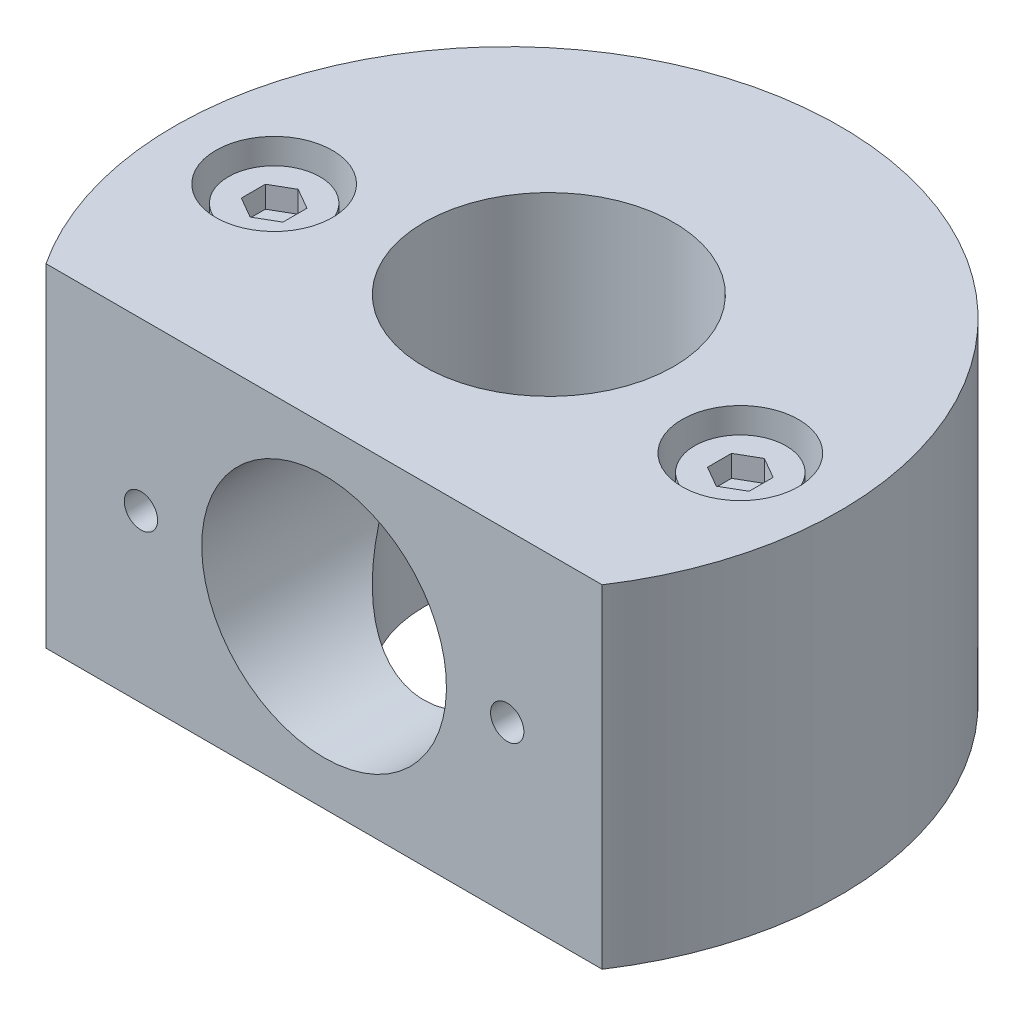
ISO-10303-21;
HEADER;
FILE_DESCRIPTION(('STEP AP214'),'2;1');
FILE_NAME('part.step','',(''),(''),'','','');
FILE_SCHEMA(('AUTOMOTIVE_DESIGN { 1 0 10303 214 1 1 1 1 }'));
ENDSEC;
DATA;
#1=APPLICATION_CONTEXT('core data for automotive mechanical design processes');
#2=APPLICATION_PROTOCOL_DEFINITION('international standard','automotive_design',2000,#1);
#3=PRODUCT_CONTEXT('',#1,'mechanical');
#4=PRODUCT('Part','Part','',(#3));
#5=PRODUCT_RELATED_PRODUCT_CATEGORY('part','',(#4));
#6=PRODUCT_DEFINITION_FORMATION('','',#4);
#7=PRODUCT_DEFINITION_CONTEXT('part definition',#1,'design');
#8=PRODUCT_DEFINITION('design','',#6,#7);
#9=PRODUCT_DEFINITION_SHAPE('','',#8);
#10=(LENGTH_UNIT() NAMED_UNIT(*) SI_UNIT(.MILLI.,.METRE.));
#11=(NAMED_UNIT(*) PLANE_ANGLE_UNIT() SI_UNIT($,.RADIAN.));
#12=(NAMED_UNIT(*) SI_UNIT($,.STERADIAN.) SOLID_ANGLE_UNIT());
#13=UNCERTAINTY_MEASURE_WITH_UNIT(LENGTH_MEASURE(1.E-05),#10,'distance_accuracy_value','');
#14=(GEOMETRIC_REPRESENTATION_CONTEXT(3) GLOBAL_UNCERTAINTY_ASSIGNED_CONTEXT((#13)) GLOBAL_UNIT_ASSIGNED_CONTEXT((#10,
#11,#12)) REPRESENTATION_CONTEXT('',''));
#15=CARTESIAN_POINT('',(0.,0.,0.));
#16=DIRECTION('',(0.,0.,1.));
#17=DIRECTION('',(1.,0.,0.));
#18=AXIS2_PLACEMENT_3D('',#15,#16,#17);
#19=CARTESIAN_POINT('',(0.,0.,0.));
#20=DIRECTION('',(0.,1.,0.));
#21=DIRECTION('',(-1.,0.,0.));
#22=AXIS2_PLACEMENT_3D('',#19,#20,#21);
#23=PLANE('',#22);
#24=CARTESIAN_POINT('',(-14.,0.,0.));
#25=DIRECTION('',(0.,1.,0.));
#26=DIRECTION('',(-1.,0.,0.));
#27=AXIS2_PLACEMENT_3D('',#24,#25,#26);
#28=CIRCLE('',#27,1.75);
#29=CARTESIAN_POINT('',(-15.75,-1.09981662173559E-13,0.));
#30=VERTEX_POINT('',#29);
#31=EDGE_CURVE('E385',#30,#30,#28,.T.);
#32=ORIENTED_EDGE('',*,*,#31,.T.);
#33=EDGE_LOOP('',(#32));
#34=FACE_BOUND('',#33,.T.);
#35=CARTESIAN_POINT('',(0.,0.,-2.5));
#36=DIRECTION('',(0.,1.,0.));
#37=DIRECTION('',(-1.,0.,0.));
#38=AXIS2_PLACEMENT_3D('',#35,#36,#37);
#39=CIRCLE('',#38,7.5);
#40=CARTESIAN_POINT('',(-7.5,0.,-2.5));
#41=VERTEX_POINT('',#40);
#42=EDGE_CURVE('E243',#41,#41,#39,.T.);
#43=ORIENTED_EDGE('',*,*,#42,.T.);
#44=EDGE_LOOP('',(#43));
#45=FACE_BOUND('',#44,.T.);
#46=CARTESIAN_POINT('',(14.,0.,0.));
#47=DIRECTION('',(0.,1.,0.));
#48=DIRECTION('',(-1.,0.,0.));
#49=AXIS2_PLACEMENT_3D('',#46,#47,#48);
#50=CIRCLE('',#49,1.75);
#51=CARTESIAN_POINT('',(12.25,0.,0.));
#52=VERTEX_POINT('',#51);
#53=EDGE_CURVE('E391',#52,#52,#50,.T.);
#54=ORIENTED_EDGE('',*,*,#53,.T.);
#55=EDGE_LOOP('',(#54));
#56=FACE_BOUND('',#55,.T.);
#57=CARTESIAN_POINT('',(0.,0.,0.));
#58=DIRECTION('',(0.,1.,0.));
#59=DIRECTION('',(-1.,0.,0.));
#60=AXIS2_PLACEMENT_3D('',#57,#58,#59);
#61=CIRCLE('',#60,20.);
#62=CARTESIAN_POINT('',(16.70329308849,1.55044766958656E-13,11.));
#63=VERTEX_POINT('',#62);
#64=CARTESIAN_POINT('',(-16.70329308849,0.,11.));
#65=VERTEX_POINT('',#64);
#66=EDGE_CURVE('E28',#63,#65,#61,.T.);
#67=ORIENTED_EDGE('',*,*,#66,.F.);
#68=DIRECTION('',(1.,0.,0.));
#69=VECTOR('',#68,1.);
#70=CARTESIAN_POINT('',(16.70329308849,1.55044766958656E-13,11.));
#71=LINE('',#70,#69);
#72=EDGE_CURVE('E413',#65,#63,#71,.T.);
#73=ORIENTED_EDGE('',*,*,#72,.F.);
#74=EDGE_LOOP('',(#67,#73));
#75=FACE_BOUND('',#74,.T.);
#76=ADVANCED_FACE('F14',(#34,#45,#56,#75),#23,.F.);
#77=CARTESIAN_POINT('',(-11.8,10.,7.));
#78=DIRECTION('',(0.,0.,-1.));
#79=DIRECTION('',(0.,-1.,0.));
#80=AXIS2_PLACEMENT_3D('',#77,#78,#79);
#81=PLANE('',#80);
#82=CARTESIAN_POINT('',(-11.,10.,7.));
#83=DIRECTION('',(0.,0.,1.));
#84=DIRECTION('',(0.,1.,0.));
#85=AXIS2_PLACEMENT_3D('',#82,#83,#84);
#86=CIRCLE('',#85,1.);
#87=CARTESIAN_POINT('',(-11.,11.,7.));
#88=VERTEX_POINT('',#87);
#89=EDGE_CURVE('E234',#88,#88,#86,.T.);
#90=ORIENTED_EDGE('',*,*,#89,.T.);
#91=EDGE_LOOP('',(#90));
#92=FACE_BOUND('',#91,.T.);
#93=ADVANCED_FACE('F261',(#92),#81,.F.);
#94=CARTESIAN_POINT('',(-11.,10.,11.));
#95=DIRECTION('',(0.,0.,1.));
#96=DIRECTION('',(0.,1.,0.));
#97=AXIS2_PLACEMENT_3D('',#94,#95,#96);
#98=CYLINDRICAL_SURFACE('',#97,1.);
#99=ORIENTED_EDGE('',*,*,#89,.F.);
#100=EDGE_LOOP('',(#99));
#101=FACE_BOUND('',#100,.T.);
#102=CARTESIAN_POINT('',(-11.,10.,11.));
#103=DIRECTION('',(0.,0.,-1.));
#104=DIRECTION('',(0.,-1.,0.));
#105=AXIS2_PLACEMENT_3D('',#102,#103,#104);
#106=CIRCLE('',#105,1.);
#107=CARTESIAN_POINT('',(-11.,9.,11.));
#108=VERTEX_POINT('',#107);
#109=EDGE_CURVE('E223',#108,#108,#106,.F.);
#110=ORIENTED_EDGE('',*,*,#109,.T.);
#111=EDGE_LOOP('',(#110));
#112=FACE_BOUND('',#111,.T.);
#113=ADVANCED_FACE('F264',(#101,#112),#98,.F.);
#114=CARTESIAN_POINT('',(13.9999999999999,20.,0.));
#115=DIRECTION('',(0.,1.,0.));
#116=DIRECTION('',(-1.,0.,0.));
#117=AXIS2_PLACEMENT_3D('',#114,#115,#116);
#118=CYLINDRICAL_SURFACE('',#117,1.75);
#119=CARTESIAN_POINT('',(14.,16.,0.));
#120=DIRECTION('',(0.,1.,0.));
#121=DIRECTION('',(-1.,0.,0.));
#122=AXIS2_PLACEMENT_3D('',#119,#120,#121);
#123=CIRCLE('',#122,1.75);
#124=CARTESIAN_POINT('',(12.25,16.,0.));
#125=VERTEX_POINT('',#124);
#126=EDGE_CURVE('E123',#125,#125,#123,.F.);
#127=ORIENTED_EDGE('',*,*,#126,.F.);
#128=EDGE_LOOP('',(#127));
#129=FACE_BOUND('',#128,.T.);
#130=ORIENTED_EDGE('',*,*,#53,.F.);
#131=EDGE_LOOP('',(#130));
#132=FACE_BOUND('',#131,.T.);
#133=ADVANCED_FACE('F280',(#129,#132),#118,.F.);
#134=CARTESIAN_POINT('',(10.5,16.,0.));
#135=DIRECTION('',(0.,-1.,0.));
#136=DIRECTION('',(1.,0.,0.));
#137=AXIS2_PLACEMENT_3D('',#134,#135,#136);
#138=PLANE('',#137);
#139=CARTESIAN_POINT('',(14.,16.,0.));
#140=DIRECTION('',(0.,-1.,0.));
#141=DIRECTION('',(1.,0.,0.));
#142=AXIS2_PLACEMENT_3D('',#139,#140,#141);
#143=CIRCLE('',#142,2.75);
#144=CARTESIAN_POINT('',(16.75,16.,0.));
#145=VERTEX_POINT('',#144);
#146=EDGE_CURVE('E9',#145,#145,#143,.F.);
#147=ORIENTED_EDGE('',*,*,#146,.F.);
#148=EDGE_LOOP('',(#147));
#149=FACE_BOUND('',#148,.T.);
#150=CARTESIAN_POINT('',(14.,16.,0.));
#151=DIRECTION('',(0.,1.,0.));
#152=DIRECTION('',(-1.,0.,0.));
#153=AXIS2_PLACEMENT_3D('',#150,#151,#152);
#154=CIRCLE('',#153,3.5);
#155=CARTESIAN_POINT('',(10.5,16.,0.));
#156=VERTEX_POINT('',#155);
#157=EDGE_CURVE('E224',#156,#156,#154,.T.);
#158=ORIENTED_EDGE('',*,*,#157,.T.);
#159=EDGE_LOOP('',(#158));
#160=FACE_BOUND('',#159,.T.);
#161=ADVANCED_FACE('F277',(#149,#160),#138,.F.);
#162=CARTESIAN_POINT('',(13.9999999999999,20.,0.));
#163=DIRECTION('',(0.,1.,0.));
#164=DIRECTION('',(-1.,0.,0.));
#165=AXIS2_PLACEMENT_3D('',#162,#163,#164);
#166=CYLINDRICAL_SURFACE('',#165,3.5);
#167=ORIENTED_EDGE('',*,*,#157,.F.);
#168=EDGE_LOOP('',(#167));
#169=FACE_BOUND('',#168,.T.);
#170=CARTESIAN_POINT('',(13.9999999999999,20.,0.));
#171=DIRECTION('',(0.,1.,0.));
#172=DIRECTION('',(-1.,0.,0.));
#173=AXIS2_PLACEMENT_3D('',#170,#171,#172);
#174=CIRCLE('',#173,3.5);
#175=CARTESIAN_POINT('',(10.4999999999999,20.,0.));
#176=VERTEX_POINT('',#175);
#177=EDGE_CURVE('E393',#176,#176,#174,.T.);
#178=ORIENTED_EDGE('',*,*,#177,.T.);
#179=EDGE_LOOP('',(#178));
#180=FACE_BOUND('',#179,.T.);
#181=ADVANCED_FACE('F270',(#169,#180),#166,.F.);
#182=CARTESIAN_POINT('',(10.2,10.,7.));
#183=DIRECTION('',(0.,0.,-1.));
#184=DIRECTION('',(0.,-1.,0.));
#185=AXIS2_PLACEMENT_3D('',#182,#183,#184);
#186=PLANE('',#185);
#187=CARTESIAN_POINT('',(11.,10.,7.));
#188=DIRECTION('',(0.,0.,1.));
#189=DIRECTION('',(0.,1.,0.));
#190=AXIS2_PLACEMENT_3D('',#187,#188,#189);
#191=CIRCLE('',#190,1.);
#192=CARTESIAN_POINT('',(11.,11.,7.));
#193=VERTEX_POINT('',#192);
#194=EDGE_CURVE('E231',#193,#193,#191,.T.);
#195=ORIENTED_EDGE('',*,*,#194,.T.);
#196=EDGE_LOOP('',(#195));
#197=FACE_BOUND('',#196,.T.);
#198=ADVANCED_FACE('F266',(#197),#186,.F.);
#199=CARTESIAN_POINT('',(11.,10.0000000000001,11.));
#200=DIRECTION('',(0.,0.,1.));
#201=DIRECTION('',(0.,1.,0.));
#202=AXIS2_PLACEMENT_3D('',#199,#200,#201);
#203=CYLINDRICAL_SURFACE('',#202,1.);
#204=ORIENTED_EDGE('',*,*,#194,.F.);
#205=EDGE_LOOP('',(#204));
#206=FACE_BOUND('',#205,.T.);
#207=CARTESIAN_POINT('',(11.,10.0000000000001,11.));
#208=DIRECTION('',(0.,0.,-1.));
#209=DIRECTION('',(0.,-1.,0.));
#210=AXIS2_PLACEMENT_3D('',#207,#208,#209);
#211=CIRCLE('',#210,1.);
#212=CARTESIAN_POINT('',(11.,9.00000000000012,11.));
#213=VERTEX_POINT('',#212);
#214=EDGE_CURVE('E228',#213,#213,#211,.F.);
#215=ORIENTED_EDGE('',*,*,#214,.T.);
#216=EDGE_LOOP('',(#215));
#217=FACE_BOUND('',#216,.T.);
#218=ADVANCED_FACE('F269',(#206,#217),#203,.F.);
#219=CARTESIAN_POINT('',(-1.39659253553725E-13,20.,0.));
#220=DIRECTION('',(0.,1.,0.));
#221=DIRECTION('',(-1.,0.,0.));
#222=AXIS2_PLACEMENT_3D('',#219,#220,#221);
#223=PLANE('',#222);
#224=ORIENTED_EDGE('',*,*,#177,.F.);
#225=EDGE_LOOP('',(#224));
#226=FACE_BOUND('',#225,.T.);
#227=CARTESIAN_POINT('',(-1.39659253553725E-13,20.,0.));
#228=DIRECTION('',(0.,1.,0.));
#229=DIRECTION('',(-1.,0.,0.));
#230=AXIS2_PLACEMENT_3D('',#227,#228,#229);
#231=CIRCLE('',#230,20.);
#232=CARTESIAN_POINT('',(-16.7032930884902,20.,11.));
#233=VERTEX_POINT('',#232);
#234=CARTESIAN_POINT('',(16.7032930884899,20.,11.));
#235=VERTEX_POINT('',#234);
#236=EDGE_CURVE('E406',#233,#235,#231,.F.);
#237=ORIENTED_EDGE('',*,*,#236,.F.);
#238=DIRECTION('',(-1.,0.,0.));
#239=VECTOR('',#238,1.);
#240=CARTESIAN_POINT('',(-1.39659253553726E-13,20.,11.));
#241=LINE('',#240,#239);
#242=EDGE_CURVE('E403',#235,#233,#241,.T.);
#243=ORIENTED_EDGE('',*,*,#242,.F.);
#244=EDGE_LOOP('',(#237,#243));
#245=FACE_BOUND('',#244,.T.);
#246=CARTESIAN_POINT('',(-1.39659253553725E-13,20.,-2.50000000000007));
#247=DIRECTION('',(0.,1.,0.));
#248=DIRECTION('',(-1.,0.,0.));
#249=AXIS2_PLACEMENT_3D('',#246,#247,#248);
#250=CIRCLE('',#249,7.5);
#251=CARTESIAN_POINT('',(-7.50000000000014,19.9999999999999,-2.50000000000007));
#252=VERTEX_POINT('',#251);
#253=EDGE_CURVE('E462',#252,#252,#250,.T.);
#254=ORIENTED_EDGE('',*,*,#253,.F.);
#255=EDGE_LOOP('',(#254));
#256=FACE_BOUND('',#255,.T.);
#257=CARTESIAN_POINT('',(-14.0000000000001,20.,0.));
#258=DIRECTION('',(0.,1.,0.));
#259=DIRECTION('',(-1.,0.,0.));
#260=AXIS2_PLACEMENT_3D('',#257,#258,#259);
#261=CIRCLE('',#260,3.5);
#262=CARTESIAN_POINT('',(-17.5000000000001,20.,0.));
#263=VERTEX_POINT('',#262);
#264=EDGE_CURVE('E409',#263,#263,#261,.T.);
#265=ORIENTED_EDGE('',*,*,#264,.F.);
#266=EDGE_LOOP('',(#265));
#267=FACE_BOUND('',#266,.T.);
#268=ADVANCED_FACE('F426',(#226,#245,#256,#267),#223,.T.);
#269=CARTESIAN_POINT('',(-1.39659253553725E-13,20.,0.));
#270=DIRECTION('',(0.,-1.,0.));
#271=DIRECTION('',(1.,0.,0.));
#272=AXIS2_PLACEMENT_3D('',#269,#270,#271);
#273=CYLINDRICAL_SURFACE('',#272,20.);
#274=DIRECTION('',(0.,-1.,0.));
#275=VECTOR('',#274,1.);
#276=CARTESIAN_POINT('',(16.7032930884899,20.,11.));
#277=LINE('',#276,#275);
#278=EDGE_CURVE('E238',#235,#63,#277,.T.);
#279=ORIENTED_EDGE('',*,*,#278,.T.);
#280=ORIENTED_EDGE('',*,*,#66,.T.);
#281=DIRECTION('',(0.,-1.,0.));
#282=VECTOR('',#281,1.);
#283=CARTESIAN_POINT('',(-16.7032930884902,20.,11.));
#284=LINE('',#283,#282);
#285=EDGE_CURVE('E240',#233,#65,#284,.T.);
#286=ORIENTED_EDGE('',*,*,#285,.F.);
#287=ORIENTED_EDGE('',*,*,#236,.T.);
#288=EDGE_LOOP('',(#279,#280,#286,#287));
#289=FACE_BOUND('',#288,.T.);
#290=ADVANCED_FACE('F428',(#289),#273,.T.);
#291=CARTESIAN_POINT('',(16.7032930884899,20.,11.));
#292=DIRECTION('',(0.,0.,-1.));
#293=DIRECTION('',(0.,-1.,0.));
#294=AXIS2_PLACEMENT_3D('',#291,#292,#293);
#295=PLANE('',#294);
#296=ORIENTED_EDGE('',*,*,#109,.F.);
#297=EDGE_LOOP('',(#296));
#298=FACE_BOUND('',#297,.T.);
#299=ORIENTED_EDGE('',*,*,#214,.F.);
#300=EDGE_LOOP('',(#299));
#301=FACE_BOUND('',#300,.T.);
#302=CARTESIAN_POINT('',(0.,10.,11.));
#303=DIRECTION('',(0.,0.,-1.));
#304=DIRECTION('',(0.,-1.,0.));
#305=AXIS2_PLACEMENT_3D('',#302,#303,#304);
#306=CIRCLE('',#305,7.35);
#307=CARTESIAN_POINT('',(0.,2.65,11.));
#308=VERTEX_POINT('',#307);
#309=EDGE_CURVE('E407',#308,#308,#306,.F.);
#310=ORIENTED_EDGE('',*,*,#309,.F.);
#311=EDGE_LOOP('',(#310));
#312=FACE_BOUND('',#311,.T.);
#313=ORIENTED_EDGE('',*,*,#285,.T.);
#314=ORIENTED_EDGE('',*,*,#72,.T.);
#315=ORIENTED_EDGE('',*,*,#278,.F.);
#316=ORIENTED_EDGE('',*,*,#242,.T.);
#317=EDGE_LOOP('',(#313,#314,#315,#316));
#318=FACE_BOUND('',#317,.T.);
#319=ADVANCED_FACE('F436',(#298,#301,#312,#318),#295,.F.);
#320=CARTESIAN_POINT('',(-1.39659253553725E-13,20.,-2.50000000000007));
#321=DIRECTION('',(0.,-1.,0.));
#322=DIRECTION('',(1.,0.,0.));
#323=AXIS2_PLACEMENT_3D('',#320,#321,#322);
#324=CYLINDRICAL_SURFACE('',#323,7.5);
#325=ORIENTED_EDGE('',*,*,#42,.F.);
#326=EDGE_LOOP('',(#325));
#327=FACE_BOUND('',#326,.T.);
#328=ORIENTED_EDGE('',*,*,#253,.T.);
#329=EDGE_LOOP('',(#328));
#330=FACE_BOUND('',#329,.T.);
#331=CARTESIAN_POINT('',(0.,2.65,5.));
#332=CARTESIAN_POINT('',(0.165197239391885,2.64999740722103,5.00000258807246));
#333=CARTESIAN_POINT('',(0.33036786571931,2.65557800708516,4.99453331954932));
#334=CARTESIAN_POINT('',(0.659308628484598,2.67777478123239,4.97278241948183));
#335=CARTESIAN_POINT('',(0.82307831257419,2.69439439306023,4.95649741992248));
#336=CARTESIAN_POINT('',(1.14792119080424,2.73834227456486,4.91344410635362));
#337=CARTESIAN_POINT('',(1.30899172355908,2.76568053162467,4.88666601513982));
#338=CARTESIAN_POINT('',(1.62713704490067,2.83053011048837,4.82316565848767));
#339=CARTESIAN_POINT('',(1.78420992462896,2.86804619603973,4.78643873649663));
#340=CARTESIAN_POINT('',(2.09214007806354,2.95225309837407,4.70403786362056));
#341=CARTESIAN_POINT('',(2.24303450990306,2.99887455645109,4.65843155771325));
#342=CARTESIAN_POINT('',(2.53906831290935,3.10071204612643,4.55886398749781));
#343=CARTESIAN_POINT('',(2.68420550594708,3.15593129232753,4.50489959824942));
#344=CARTESIAN_POINT('',(3.110007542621,3.33331196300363,4.33165994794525));
#345=CARTESIAN_POINT('',(3.38130046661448,3.46726307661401,4.20097279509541));
#346=CARTESIAN_POINT('',(3.81976802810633,3.717040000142,3.9577501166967));
#347=CARTESIAN_POINT('',(3.99406664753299,3.82657567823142,3.85121355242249));
#348=CARTESIAN_POINT('',(4.32863243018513,4.05638342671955,3.62807649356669));
#349=CARTESIAN_POINT('',(4.48889827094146,4.1766565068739,3.51147505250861));
#350=CARTESIAN_POINT('',(4.79575229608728,4.42662184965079,3.2696651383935));
#351=CARTESIAN_POINT('',(4.94230578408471,4.55633660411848,3.14443615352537));
#352=CARTESIAN_POINT('',(5.22155550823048,4.8235916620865,2.88715138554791));
#353=CARTESIAN_POINT('',(5.35425201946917,4.96113181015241,2.75509573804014));
#354=CARTESIAN_POINT('',(5.6531269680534,5.29553262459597,2.43521017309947));
#355=CARTESIAN_POINT('',(5.81334973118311,5.49539558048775,2.2449378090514));
#356=CARTESIAN_POINT('',(6.1094278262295,5.90591990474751,1.85711555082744));
#357=CARTESIAN_POINT('',(6.2452696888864,6.11658715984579,1.65956170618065));
#358=CARTESIAN_POINT('',(6.49328884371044,6.54726081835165,1.26061044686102));
#359=CARTESIAN_POINT('',(6.60550280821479,6.76725210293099,1.05921952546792));
#360=CARTESIAN_POINT('',(6.7567855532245,7.10457372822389,0.757077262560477));
#361=CARTESIAN_POINT('',(6.80436505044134,7.21821154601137,0.656375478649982));
#362=CARTESIAN_POINT('',(6.89392985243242,7.44824209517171,0.455638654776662));
#363=CARTESIAN_POINT('',(6.93591570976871,7.56463455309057,0.355603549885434));
#364=CARTESIAN_POINT('',(7.02622084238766,7.83643255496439,0.127076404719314));
#365=CARTESIAN_POINT('',(7.07259967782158,7.99296529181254,-0.00084590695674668));
#366=CARTESIAN_POINT('',(7.15588887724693,8.31378226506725,-0.250458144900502));
#367=CARTESIAN_POINT('',(7.19279104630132,8.4780730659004,-0.372142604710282));
#368=CARTESIAN_POINT('',(7.24794469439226,8.77286966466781,-0.570008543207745));
#369=CARTESIAN_POINT('',(7.26854335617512,8.90059486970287,-0.649632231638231));
#370=CARTESIAN_POINT('',(7.30366710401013,9.16532067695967,-0.793587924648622));
#371=CARTESIAN_POINT('',(7.31821165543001,9.30228988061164,-0.857968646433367));
#372=CARTESIAN_POINT('',(7.33548069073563,9.53039025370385,-0.93740351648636));
#373=CARTESIAN_POINT('',(7.340606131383,9.61792099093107,-0.961886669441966));
#374=CARTESIAN_POINT('',(7.34769869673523,9.79581833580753,-0.996123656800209));
#375=CARTESIAN_POINT('',(7.3496763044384,9.88617450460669,-1.00592637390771));
#376=CARTESIAN_POINT('',(7.35025100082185,10.0675942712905,-1.00875333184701));
#377=CARTESIAN_POINT('',(7.34883263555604,10.1586592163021,-1.00170087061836));
#378=CARTESIAN_POINT('',(7.34276667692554,10.3382410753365,-0.972260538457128));
#379=CARTESIAN_POINT('',(7.33811013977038,10.4267502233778,-0.949830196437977));
#380=CARTESIAN_POINT('',(7.32207449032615,10.6559383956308,-0.875385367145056));
#381=CARTESIAN_POINT('',(7.30829344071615,10.7931654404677,-0.813618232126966));
#382=CARTESIAN_POINT('',(7.28308232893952,10.9918141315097,-0.708893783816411));
#383=CARTESIAN_POINT('',(7.27388837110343,11.0570120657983,-0.671846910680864));
#384=CARTESIAN_POINT('',(7.25407231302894,11.1853880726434,-0.59474199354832));
#385=CARTESIAN_POINT('',(7.24345071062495,11.2485668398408,-0.554685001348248));
#386=CARTESIAN_POINT('',(7.21163741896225,11.4240956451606,-0.43886731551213));
#387=CARTESIAN_POINT('',(7.18889132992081,11.5345147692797,-0.360637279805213));
#388=CARTESIAN_POINT('',(7.1391532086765,11.751385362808,-0.200090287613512));
#389=CARTESIAN_POINT('',(7.11215893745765,11.8578347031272,-0.117771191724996));
#390=CARTESIAN_POINT('',(7.05396480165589,12.0678420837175,0.0493975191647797));
#391=CARTESIAN_POINT('',(7.02275801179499,12.171395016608,0.134251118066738));
#392=CARTESIAN_POINT('',(6.95619205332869,12.376016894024,0.305321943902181));
#393=CARTESIAN_POINT('',(6.92083235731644,12.4770855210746,0.391539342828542));
#394=CARTESIAN_POINT('',(6.80838088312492,12.777459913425,0.651439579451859));
#395=CARTESIAN_POINT('',(6.72500805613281,12.9736070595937,0.826102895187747));
#396=CARTESIAN_POINT('',(6.5412991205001,13.3584616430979,1.17426093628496));
#397=CARTESIAN_POINT('',(6.44097900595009,13.5471758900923,1.34775660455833));
#398=CARTESIAN_POINT('',(6.22294860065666,13.9170680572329,1.69120711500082));
#399=CARTESIAN_POINT('',(6.10526504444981,14.098257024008,1.86116695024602));
#400=CARTESIAN_POINT('',(5.85174238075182,14.452764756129,2.19587304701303));
#401=CARTESIAN_POINT('',(5.7158969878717,14.6260807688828,2.36061747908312));
#402=CARTESIAN_POINT('',(5.4257544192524,14.96316343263,2.68246991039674));
#403=CARTESIAN_POINT('',(5.27150239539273,15.1269520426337,2.83959531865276));
#404=CARTESIAN_POINT('',(4.94384534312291,15.4436047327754,3.14433250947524));
#405=CARTESIAN_POINT('',(4.77044921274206,15.5964738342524,3.29194866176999));
#406=CARTESIAN_POINT('',(4.32932121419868,15.9487907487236,3.63293730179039));
#407=CARTESIAN_POINT('',(4.05185482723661,16.1419781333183,3.82058015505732));
#408=CARTESIAN_POINT('',(3.60702432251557,16.4063776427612,4.07790044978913));
#409=CARTESIAN_POINT('',(3.45396740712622,16.4902840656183,4.15965332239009));
#410=CARTESIAN_POINT('',(3.13858843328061,16.6485213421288,4.31395820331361));
#411=CARTESIAN_POINT('',(2.97627192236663,16.7228578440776,4.38651563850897));
#412=CARTESIAN_POINT('',(2.67011344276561,16.8495108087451,4.51021724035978));
#413=CARTESIAN_POINT('',(2.52756789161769,16.9034417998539,4.56292430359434));
#414=CARTESIAN_POINT('',(2.23698353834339,17.0029973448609,4.66026274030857));
#415=CARTESIAN_POINT('',(2.08894740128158,17.0486258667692,4.70489797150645));
#416=CARTESIAN_POINT('',(1.78809859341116,17.1308845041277,4.78539237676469));
#417=CARTESIAN_POINT('',(1.63528725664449,17.1675171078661,4.8212539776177));
#418=CARTESIAN_POINT('',(1.3257775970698,17.23116668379,4.8835783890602));
#419=CARTESIAN_POINT('',(1.16907924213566,17.2581835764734,4.91004112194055));
#420=CARTESIAN_POINT('',(0.852103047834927,17.3022018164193,4.95316252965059));
#421=CARTESIAN_POINT('',(0.691810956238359,17.3191510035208,4.96977014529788));
#422=CARTESIAN_POINT('',(0.369718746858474,17.3424708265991,4.99262119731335));
#423=CARTESIAN_POINT('',(0.207918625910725,17.348841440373,4.99886461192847));
#424=CARTESIAN_POINT('',(-0.115791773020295,17.3508698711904,5.00085247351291));
#425=CARTESIAN_POINT('',(-0.277702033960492,17.3465290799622,4.99659828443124));
#426=CARTESIAN_POINT('',(-0.600268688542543,17.3272287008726,4.97768525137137));
#427=CARTESIAN_POINT('',(-0.760925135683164,17.3122695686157,4.96302685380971));
#428=CARTESIAN_POINT('',(-1.06649912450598,17.2737064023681,4.92524688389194));
#429=CARTESIAN_POINT('',(-1.2116205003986,17.2509185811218,4.90292446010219));
#430=CARTESIAN_POINT('',(-1.49886144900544,17.1970324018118,4.85015276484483));
#431=CARTESIAN_POINT('',(-1.64097987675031,17.1659309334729,4.81970045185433));
#432=CARTESIAN_POINT('',(-1.92137462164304,17.0958932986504,4.75114819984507));
#433=CARTESIAN_POINT('',(-2.05965105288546,17.0569573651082,4.71304848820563));
#434=CARTESIAN_POINT('',(-2.33175076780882,16.9717842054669,4.62974029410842));
#435=CARTESIAN_POINT('',(-2.46557314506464,16.9255455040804,4.58453037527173));
#436=CARTESIAN_POINT('',(-2.77036191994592,16.8104290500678,4.4720333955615));
#437=CARTESIAN_POINT('',(-2.93949363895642,16.739044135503,4.40231360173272));
#438=CARTESIAN_POINT('',(-3.26829678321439,16.5858700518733,4.25284432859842));
#439=CARTESIAN_POINT('',(-3.42796573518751,16.5040781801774,4.17309224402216));
#440=CARTESIAN_POINT('',(-3.89246990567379,16.2447490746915,3.92050131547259));
#441=CARTESIAN_POINT('',(-4.18259882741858,16.0533376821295,3.73440546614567));
#442=CARTESIAN_POINT('',(-4.63530248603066,15.7087309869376,3.40050235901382));
#443=CARTESIAN_POINT('',(-4.80895421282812,15.5629521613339,3.25954220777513));
#444=CARTESIAN_POINT('',(-5.13800267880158,15.2605430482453,2.96801534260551));
#445=CARTESIAN_POINT('',(-5.29339210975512,15.1039084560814,2.81744481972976));
#446=CARTESIAN_POINT('',(-5.58655577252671,14.7812690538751,2.50857737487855));
#447=CARTESIAN_POINT('',(-5.72429429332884,14.6152461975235,2.35026565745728));
#448=CARTESIAN_POINT('',(-5.98238641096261,14.2754020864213,2.02809384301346));
#449=CARTESIAN_POINT('',(-6.10274392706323,14.1015826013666,1.86423500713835));
#450=CARTESIAN_POINT('',(-6.33031989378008,13.7411829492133,1.52736583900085));
#451=CARTESIAN_POINT('',(-6.43698680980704,13.5543718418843,1.35423097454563));
#452=CARTESIAN_POINT('',(-6.63307464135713,13.1734430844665,1.00603353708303));
#453=CARTESIAN_POINT('',(-6.72248549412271,12.9793212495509,0.83096990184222));
#454=CARTESIAN_POINT('',(-6.88421651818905,12.5837408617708,0.482322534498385));
#455=CARTESIAN_POINT('',(-6.95658172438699,12.3823033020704,0.308736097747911));
#456=CARTESIAN_POINT('',(-7.05259688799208,12.0724396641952,0.0532705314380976));
#457=CARTESIAN_POINT('',(-7.08250198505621,11.9679184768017,-0.0310269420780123));
#458=CARTESIAN_POINT('',(-7.1381104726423,11.7555451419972,-0.196742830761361));
#459=CARTESIAN_POINT('',(-7.16381506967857,11.6476939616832,-0.27816206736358));
#460=CARTESIAN_POINT('',(-7.21309817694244,11.4173475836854,-0.443471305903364));
#461=CARTESIAN_POINT('',(-7.23625876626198,11.2944216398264,-0.526890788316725));
#462=CARTESIAN_POINT('',(-7.27705228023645,11.0409161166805,-0.683148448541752));
#463=CARTESIAN_POINT('',(-7.29468937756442,10.9103424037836,-0.755994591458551));
#464=CARTESIAN_POINT('',(-7.31860591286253,10.6845779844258,-0.859921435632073));
#465=CARTESIAN_POINT('',(-7.32670940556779,10.5923358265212,-0.89679792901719));
#466=CARTESIAN_POINT('',(-7.33953355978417,10.4033135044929,-0.956566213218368));
#467=CARTESIAN_POINT('',(-7.3442663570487,10.306550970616,-0.9795081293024));
#468=CARTESIAN_POINT('',(-7.34986834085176,10.1086665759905,-1.00678868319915));
#469=CARTESIAN_POINT('',(-7.35068002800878,10.0075016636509,-1.01085042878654));
#470=CARTESIAN_POINT('',(-7.34814318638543,9.80649776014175,-0.998397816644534));
#471=CARTESIAN_POINT('',(-7.34478971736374,9.70666048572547,-0.981859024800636));
#472=CARTESIAN_POINT('',(-7.3329794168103,9.48473113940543,-0.925712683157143));
#473=CARTESIAN_POINT('',(-7.32337224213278,9.36407445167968,-0.881009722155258));
#474=CARTESIAN_POINT('',(-7.29930267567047,9.13014354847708,-0.775731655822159));
#475=CARTESIAN_POINT('',(-7.28481309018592,9.01691502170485,-0.715068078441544));
#476=CARTESIAN_POINT('',(-7.25394270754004,8.81171973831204,-0.593772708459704));
#477=CARTESIAN_POINT('',(-7.2380980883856,8.71897391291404,-0.534289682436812));
#478=CARTESIAN_POINT('',(-7.2035002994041,8.53689853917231,-0.411054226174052));
#479=CARTESIAN_POINT('',(-7.18474571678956,8.4475706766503,-0.347299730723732));
#480=CARTESIAN_POINT('',(-7.12421969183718,8.18318386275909,-0.151801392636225));
#481=CARTESIAN_POINT('',(-7.07824001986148,8.01206781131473,-0.0160444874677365));
#482=CARTESIAN_POINT('',(-6.97518457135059,7.67617420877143,0.260208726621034));
#483=CARTESIAN_POINT('',(-6.91806848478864,7.51142237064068,0.400720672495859));
#484=CARTESIAN_POINT('',(-6.79284028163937,7.18754180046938,0.682944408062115));
#485=CARTESIAN_POINT('',(-6.72473946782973,7.02840749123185,0.824654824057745));
#486=CARTESIAN_POINT('',(-6.54603747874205,6.64846911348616,1.16755872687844));
#487=CARTESIAN_POINT('',(-6.42965826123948,6.43012184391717,1.36850001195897));
#488=CARTESIAN_POINT('',(-6.17323479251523,6.0030368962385,1.76581537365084));
#489=CARTESIAN_POINT('',(-6.03317460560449,5.79430581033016,1.9621862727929));
#490=CARTESIAN_POINT('',(-5.72895447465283,5.38853361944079,2.34653653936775));
#491=CARTESIAN_POINT('',(-5.56487934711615,5.19145466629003,2.5345425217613));
#492=CARTESIAN_POINT('',(-5.21148427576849,4.81054618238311,2.89953563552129));
#493=CARTESIAN_POINT('',(-5.02218344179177,4.62670678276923,3.07653096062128));
#494=CARTESIAN_POINT('',(-4.56648333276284,4.23094639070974,3.45870895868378));
#495=CARTESIAN_POINT('',(-4.29263864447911,4.02348729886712,3.65988350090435));
#496=CARTESIAN_POINT('',(-3.85118653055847,3.73728080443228,3.9380634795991));
#497=CARTESIAN_POINT('',(-3.69890404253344,3.64603406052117,4.02686792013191));
#498=CARTESIAN_POINT('',(-3.38429626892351,3.47303921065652,4.19539638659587));
#499=CARTESIAN_POINT('',(-3.22197692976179,3.39128556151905,4.27512571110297));
#500=CARTESIAN_POINT('',(-2.91600672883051,3.25146486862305,4.41158710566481));
#501=CARTESIAN_POINT('',(-2.77383331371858,3.19172936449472,4.4699289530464));
#502=CARTESIAN_POINT('',(-2.48339538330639,3.08050510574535,4.57861354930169));
#503=CARTESIAN_POINT('',(-2.33513382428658,3.02901240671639,4.62896012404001));
#504=CARTESIAN_POINT('',(-2.03332570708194,2.9350850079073,4.72083295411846));
#505=CARTESIAN_POINT('',(-1.87978651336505,2.89263823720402,4.76237096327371));
#506=CARTESIAN_POINT('',(-1.56817636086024,2.81745091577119,4.83596976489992));
#507=CARTESIAN_POINT('',(-1.41010678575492,2.78470743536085,4.86803341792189));
#508=CARTESIAN_POINT('',(-1.04583019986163,2.72183195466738,4.9296149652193));
#509=CARTESIAN_POINT('',(-0.838493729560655,2.69497556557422,4.95592846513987));
#510=CARTESIAN_POINT('',(-0.420757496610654,2.65905958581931,4.99112095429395));
#511=CARTESIAN_POINT('',(-0.210357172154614,2.65000330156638,4.99999670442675));
#512=CARTESIAN_POINT('',(0.,2.65,5.));
#513=B_SPLINE_CURVE_WITH_KNOTS('',3,(#331,#332,#333,#334,#335,#336,#337,#338,#339,#340,#341,
#342,#343,#344,#345,#346,#347,#348,#349,#350,#351,#352,#353,#354,#355,#356,#357,#358,#359,#360,
#361,#362,#363,#364,#365,#366,#367,#368,#369,#370,#371,#372,#373,#374,#375,#376,#377,#378,#379,
#380,#381,#382,#383,#384,#385,#386,#387,#388,#389,#390,#391,#392,#393,#394,#395,#396,#397,#398,
#399,#400,#401,#402,#403,#404,#405,#406,#407,#408,#409,#410,#411,#412,#413,#414,#415,#416,#417,
#418,#419,#420,#421,#422,#423,#424,#425,#426,#427,#428,#429,#430,#431,#432,#433,#434,#435,#436,
#437,#438,#439,#440,#441,#442,#443,#444,#445,#446,#447,#448,#449,#450,#451,#452,#453,#454,#455,
#456,#457,#458,#459,#460,#461,#462,#463,#464,#465,#466,#467,#468,#469,#470,#471,#472,#473,#474,
#475,#476,#477,#478,#479,#480,#481,#482,#483,#484,#485,#486,#487,#488,#489,#490,#491,#492,#493,
#494,#495,#496,#497,#498,#499,#500,#501,#502,#503,#504,#505,#506,#507,#508,#509,#510,#511,#512),
.UNSPECIFIED.,.T.,.F.,(4,2,2,2,2,2,2,2,2,2,2,2,2,2,2,2,2,2,2,2,2,2,2,2,2,2,2,2,2,2,2,2,2,2,2,2,
2,2,2,2,2,2,2,2,2,2,2,2,2,2,2,2,2,2,2,2,2,2,2,2,2,2,2,2,2,2,2,2,2,2,2,2,2,2,2,2,2,2,2,2,2,2,2,2,
2,2,2,2,2,2,4),(0.,0.495363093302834,0.990880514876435,1.48686074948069,1.98307353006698,
2.47564436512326,2.96839981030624,3.95315295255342,4.64772750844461,5.34236745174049,
6.03872002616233,6.73505877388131,7.69094575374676,8.6473591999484,9.60227709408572,
10.0795312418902,10.5567382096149,11.1786583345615,11.801114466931,12.2563522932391,
12.710114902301,12.9822261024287,13.2534292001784,13.5258687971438,13.7990638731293,
14.2496935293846,14.4763403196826,14.7029082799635,15.1142998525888,15.5259089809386,
15.9382032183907,16.3505498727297,17.1765375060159,18.0017499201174,18.8257047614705,
19.6499454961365,20.4722043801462,21.2940826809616,22.4493578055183,23.0270523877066,
23.6044044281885,24.0877289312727,24.5708218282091,25.053780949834,25.5367440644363,
26.0221880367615,26.5076330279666,26.9930149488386,27.4783760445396,27.9236427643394,
28.3690762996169,28.8144965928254,29.2600069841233,29.8482399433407,30.4366259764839,
31.6140851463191,32.4141281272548,33.2144901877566,34.0164467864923,34.8182222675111,
35.6459554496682,36.4741698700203,37.3001709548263,37.7127814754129,38.125273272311,
38.5759998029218,39.0263850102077,39.3246189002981,39.6217735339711,39.923272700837,
40.2251298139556,40.6100462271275,40.9971429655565,41.3308695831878,41.6647587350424,
42.333776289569,43.0052619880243,43.6760611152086,44.6312447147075,45.5870736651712,
46.5396048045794,47.4914184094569,48.6810711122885,49.2760224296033,49.8706245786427,
50.3647978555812,50.8587339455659,51.352006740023,51.8451304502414,52.4757937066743,
53.1065740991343),.UNSPECIFIED.);
#514=CARTESIAN_POINT('',(0.,2.65,5.));
#515=VERTEX_POINT('',#514);
#516=EDGE_CURVE('E237',#515,#515,#513,.T.);
#517=ORIENTED_EDGE('',*,*,#516,.T.);
#518=EDGE_LOOP('',(#517));
#519=FACE_BOUND('',#518,.T.);
#520=ADVANCED_FACE('F252',(#327,#330,#519),#324,.F.);
#521=CARTESIAN_POINT('',(0.,10.,11.));
#522=DIRECTION('',(0.,0.,-1.));
#523=DIRECTION('',(0.,-1.,0.));
#524=AXIS2_PLACEMENT_3D('',#521,#522,#523);
#525=CYLINDRICAL_SURFACE('',#524,7.35);
#526=ORIENTED_EDGE('',*,*,#309,.T.);
#527=EDGE_LOOP('',(#526));
#528=FACE_BOUND('',#527,.T.);
#529=ORIENTED_EDGE('',*,*,#516,.F.);
#530=EDGE_LOOP('',(#529));
#531=FACE_BOUND('',#530,.T.);
#532=ADVANCED_FACE('F255',(#528,#531),#525,.F.);
#533=CARTESIAN_POINT('',(-14.0000000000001,20.,0.));
#534=DIRECTION('',(0.,1.,0.));
#535=DIRECTION('',(-1.,0.,0.));
#536=AXIS2_PLACEMENT_3D('',#533,#534,#535);
#537=CYLINDRICAL_SURFACE('',#536,3.5);
#538=CARTESIAN_POINT('',(-14.,16.,0.));
#539=DIRECTION('',(0.,1.,0.));
#540=DIRECTION('',(-1.,0.,0.));
#541=AXIS2_PLACEMENT_3D('',#538,#539,#540);
#542=CIRCLE('',#541,3.5);
#543=CARTESIAN_POINT('',(-17.5,16.,0.));
#544=VERTEX_POINT('',#543);
#545=EDGE_CURVE('E227',#544,#544,#542,.T.);
#546=ORIENTED_EDGE('',*,*,#545,.F.);
#547=EDGE_LOOP('',(#546));
#548=FACE_BOUND('',#547,.T.);
#549=ORIENTED_EDGE('',*,*,#264,.T.);
#550=EDGE_LOOP('',(#549));
#551=FACE_BOUND('',#550,.T.);
#552=ADVANCED_FACE('F259',(#548,#551),#537,.F.);
#553=CARTESIAN_POINT('',(-17.5,16.,0.));
#554=DIRECTION('',(0.,-1.,0.));
#555=DIRECTION('',(1.,0.,0.));
#556=AXIS2_PLACEMENT_3D('',#553,#554,#555);
#557=PLANE('',#556);
#558=CARTESIAN_POINT('',(-14.,16.,0.));
#559=DIRECTION('',(0.,-1.,0.));
#560=DIRECTION('',(1.,0.,0.));
#561=AXIS2_PLACEMENT_3D('',#558,#559,#560);
#562=CIRCLE('',#561,2.75);
#563=CARTESIAN_POINT('',(-11.25,16.,0.));
#564=VERTEX_POINT('',#563);
#565=EDGE_CURVE('E21',#564,#564,#562,.F.);
#566=ORIENTED_EDGE('',*,*,#565,.F.);
#567=EDGE_LOOP('',(#566));
#568=FACE_BOUND('',#567,.T.);
#569=ORIENTED_EDGE('',*,*,#545,.T.);
#570=EDGE_LOOP('',(#569));
#571=FACE_BOUND('',#570,.T.);
#572=ADVANCED_FACE('F272',(#568,#571),#557,.F.);
#573=CARTESIAN_POINT('',(-14.0000000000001,20.,0.));
#574=DIRECTION('',(0.,1.,0.));
#575=DIRECTION('',(-1.,0.,0.));
#576=AXIS2_PLACEMENT_3D('',#573,#574,#575);
#577=CYLINDRICAL_SURFACE('',#576,1.75);
#578=CARTESIAN_POINT('',(-14.,16.,0.));
#579=DIRECTION('',(0.,1.,0.));
#580=DIRECTION('',(-1.,0.,0.));
#581=AXIS2_PLACEMENT_3D('',#578,#579,#580);
#582=CIRCLE('',#581,1.75);
#583=CARTESIAN_POINT('',(-15.75,16.,0.));
#584=VERTEX_POINT('',#583);
#585=EDGE_CURVE('E220',#584,#584,#582,.F.);
#586=ORIENTED_EDGE('',*,*,#585,.F.);
#587=EDGE_LOOP('',(#586));
#588=FACE_BOUND('',#587,.T.);
#589=ORIENTED_EDGE('',*,*,#31,.F.);
#590=EDGE_LOOP('',(#589));
#591=FACE_BOUND('',#590,.T.);
#592=ADVANCED_FACE('F275',(#588,#591),#577,.F.);
#593=CARTESIAN_POINT('',(-14.,-4.0000000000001,0.));
#594=DIRECTION('',(0.,1.,0.));
#595=DIRECTION('',(-1.,0.,0.));
#596=AXIS2_PLACEMENT_3D('',#593,#594,#595);
#597=PLANE('',#596);
#598=CARTESIAN_POINT('',(-14.,-4.0000000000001,0.));
#599=DIRECTION('',(0.,1.,0.));
#600=DIRECTION('',(-1.,0.,0.));
#601=AXIS2_PLACEMENT_3D('',#598,#599,#600);
#602=CIRCLE('',#601,1.5);
#603=CARTESIAN_POINT('',(-15.5,-4.00000000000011,0.));
#604=VERTEX_POINT('',#603);
#605=EDGE_CURVE('E212',#604,#604,#602,.T.);
#606=ORIENTED_EDGE('',*,*,#605,.F.);
#607=EDGE_LOOP('',(#606));
#608=FACE_BOUND('',#607,.T.);
#609=ADVANCED_FACE('F298',(#608),#597,.F.);
#610=CARTESIAN_POINT('',(-14.,-4.0000000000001,0.));
#611=DIRECTION('',(0.,1.,0.));
#612=DIRECTION('',(-1.,0.,0.));
#613=AXIS2_PLACEMENT_3D('',#610,#611,#612);
#614=CYLINDRICAL_SURFACE('',#613,1.5);
#615=ORIENTED_EDGE('',*,*,#605,.T.);
#616=EDGE_LOOP('',(#615));
#617=FACE_BOUND('',#616,.T.);
#618=CARTESIAN_POINT('',(-14.,16.,0.));
#619=DIRECTION('',(0.,1.,0.));
#620=DIRECTION('',(-1.,0.,0.));
#621=AXIS2_PLACEMENT_3D('',#618,#619,#620);
#622=CIRCLE('',#621,1.5);
#623=CARTESIAN_POINT('',(-15.5,16.,0.));
#624=VERTEX_POINT('',#623);
#625=EDGE_CURVE('E201',#624,#624,#622,.T.);
#626=ORIENTED_EDGE('',*,*,#625,.F.);
#627=EDGE_LOOP('',(#626));
#628=FACE_BOUND('',#627,.T.);
#629=ADVANCED_FACE('F290',(#617,#628),#614,.T.);
#630=CARTESIAN_POINT('',(-14.,16.,0.));
#631=DIRECTION('',(0.,1.,0.));
#632=DIRECTION('',(-1.,0.,0.));
#633=AXIS2_PLACEMENT_3D('',#630,#631,#632);
#634=PLANE('',#633);
#635=ORIENTED_EDGE('',*,*,#625,.T.);
#636=EDGE_LOOP('',(#635));
#637=FACE_BOUND('',#636,.T.);
#638=ORIENTED_EDGE('',*,*,#585,.T.);
#639=EDGE_LOOP('',(#638));
#640=FACE_BOUND('',#639,.T.);
#641=ADVANCED_FACE('F286',(#637,#640),#634,.F.);
#642=CARTESIAN_POINT('',(-14.0000000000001,19.,0.));
#643=DIRECTION('',(0.,-1.,0.));
#644=DIRECTION('',(1.,0.,0.));
#645=AXIS2_PLACEMENT_3D('',#642,#643,#644);
#646=CYLINDRICAL_SURFACE('',#645,2.75);
#647=CARTESIAN_POINT('',(-14.0000000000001,19.,0.));
#648=DIRECTION('',(0.,1.,0.));
#649=DIRECTION('',(-1.,0.,0.));
#650=AXIS2_PLACEMENT_3D('',#647,#648,#649);
#651=CIRCLE('',#650,2.75);
#652=CARTESIAN_POINT('',(-16.7500000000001,19.,0.));
#653=VERTEX_POINT('',#652);
#654=EDGE_CURVE('E215',#653,#653,#651,.T.);
#655=ORIENTED_EDGE('',*,*,#654,.F.);
#656=EDGE_LOOP('',(#655));
#657=FACE_BOUND('',#656,.T.);
#658=ORIENTED_EDGE('',*,*,#565,.T.);
#659=EDGE_LOOP('',(#658));
#660=FACE_BOUND('',#659,.T.);
#661=ADVANCED_FACE('F282',(#657,#660),#646,.T.);
#662=CARTESIAN_POINT('',(-14.0000000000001,19.,0.));
#663=DIRECTION('',(0.,1.,0.));
#664=DIRECTION('',(-1.,0.,0.));
#665=AXIS2_PLACEMENT_3D('',#662,#663,#664);
#666=PLANE('',#665);
#667=DIRECTION('',(0.866025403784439,0.,0.5));
#668=VECTOR('',#667,1.);
#669=CARTESIAN_POINT('',(-15.25,19.,0.721687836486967));
#670=LINE('',#669,#668);
#671=CARTESIAN_POINT('',(-15.25,19.,0.721687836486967));
#672=VERTEX_POINT('',#671);
#673=CARTESIAN_POINT('',(-14.0000000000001,19.,1.443375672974));
#674=VERTEX_POINT('',#673);
#675=EDGE_CURVE('E163',#672,#674,#670,.T.);
#676=ORIENTED_EDGE('',*,*,#675,.F.);
#677=DIRECTION('',(0.,0.,1.));
#678=VECTOR('',#677,1.);
#679=CARTESIAN_POINT('',(-15.25,19.,-0.721687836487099));
#680=LINE('',#679,#678);
#681=CARTESIAN_POINT('',(-15.25,19.,-0.721687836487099));
#682=VERTEX_POINT('',#681);
#683=EDGE_CURVE('E168',#682,#672,#680,.T.);
#684=ORIENTED_EDGE('',*,*,#683,.F.);
#685=DIRECTION('',(-0.866025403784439,0.,0.5));
#686=VECTOR('',#685,1.);
#687=CARTESIAN_POINT('',(-14.0000000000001,19.,-1.44337567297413));
#688=LINE('',#687,#686);
#689=CARTESIAN_POINT('',(-14.0000000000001,19.,-1.44337567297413));
#690=VERTEX_POINT('',#689);
#691=EDGE_CURVE('E194',#690,#682,#688,.T.);
#692=ORIENTED_EDGE('',*,*,#691,.F.);
#693=DIRECTION('',(-0.866025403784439,0.,-0.5));
#694=VECTOR('',#693,1.);
#695=CARTESIAN_POINT('',(-12.7500000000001,19.,-0.721687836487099));
#696=LINE('',#695,#694);
#697=CARTESIAN_POINT('',(-12.7500000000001,19.,-0.721687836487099));
#698=VERTEX_POINT('',#697);
#699=EDGE_CURVE('E191',#698,#690,#696,.T.);
#700=ORIENTED_EDGE('',*,*,#699,.F.);
#701=DIRECTION('',(0.,0.,-1.));
#702=VECTOR('',#701,1.);
#703=CARTESIAN_POINT('',(-12.7500000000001,19.,0.721687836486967));
#704=LINE('',#703,#702);
#705=CARTESIAN_POINT('',(-12.7500000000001,19.,0.721687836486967));
#706=VERTEX_POINT('',#705);
#707=EDGE_CURVE('E188',#706,#698,#704,.T.);
#708=ORIENTED_EDGE('',*,*,#707,.F.);
#709=DIRECTION('',(0.866025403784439,0.,-0.5));
#710=VECTOR('',#709,1.);
#711=CARTESIAN_POINT('',(-14.0000000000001,19.,1.443375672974));
#712=LINE('',#711,#710);
#713=EDGE_CURVE('E185',#674,#706,#712,.T.);
#714=ORIENTED_EDGE('',*,*,#713,.F.);
#715=EDGE_LOOP('',(#676,#684,#692,#700,#708,#714));
#716=FACE_BOUND('',#715,.T.);
#717=ORIENTED_EDGE('',*,*,#654,.T.);
#718=EDGE_LOOP('',(#717));
#719=FACE_BOUND('',#718,.T.);
#720=ADVANCED_FACE('F285',(#716,#719),#666,.T.);
#721=CARTESIAN_POINT('',(-15.25,17.7,0.721687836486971));
#722=DIRECTION('',(-0.5,0.,0.866025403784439));
#723=DIRECTION('',(0.866025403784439,0.,0.5));
#724=AXIS2_PLACEMENT_3D('',#721,#722,#723);
#725=PLANE('',#724);
#726=ORIENTED_EDGE('',*,*,#675,.T.);
#727=DIRECTION('',(0.,1.,0.));
#728=VECTOR('',#727,1.);
#729=CARTESIAN_POINT('',(-14.0000000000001,17.7,1.443375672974));
#730=LINE('',#729,#728);
#731=CARTESIAN_POINT('',(-14.0000000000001,17.7,1.443375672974));
#732=VERTEX_POINT('',#731);
#733=EDGE_CURVE('E183',#732,#674,#730,.T.);
#734=ORIENTED_EDGE('',*,*,#733,.F.);
#735=DIRECTION('',(0.866025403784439,0.,0.5));
#736=VECTOR('',#735,1.);
#737=CARTESIAN_POINT('',(-15.25,17.7,0.721687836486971));
#738=LINE('',#737,#736);
#739=CARTESIAN_POINT('',(-15.25,17.7,0.721687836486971));
#740=VERTEX_POINT('',#739);
#741=EDGE_CURVE('E164',#740,#732,#738,.T.);
#742=ORIENTED_EDGE('',*,*,#741,.F.);
#743=DIRECTION('',(0.,1.,0.));
#744=VECTOR('',#743,1.);
#745=CARTESIAN_POINT('',(-15.25,17.7,0.721687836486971));
#746=LINE('',#745,#744);
#747=EDGE_CURVE('E199',#740,#672,#746,.T.);
#748=ORIENTED_EDGE('',*,*,#747,.T.);
#749=EDGE_LOOP('',(#726,#734,#742,#748));
#750=FACE_BOUND('',#749,.T.);
#751=ADVANCED_FACE('F294',(#750),#725,.F.);
#752=CARTESIAN_POINT('',(-15.25,17.7,-0.721687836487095));
#753=DIRECTION('',(-1.,0.,0.));
#754=DIRECTION('',(0.,0.,1.));
#755=AXIS2_PLACEMENT_3D('',#752,#753,#754);
#756=PLANE('',#755);
#757=ORIENTED_EDGE('',*,*,#683,.T.);
#758=ORIENTED_EDGE('',*,*,#747,.F.);
#759=DIRECTION('',(0.,0.,1.));
#760=VECTOR('',#759,1.);
#761=CARTESIAN_POINT('',(-15.25,17.7,-0.721687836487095));
#762=LINE('',#761,#760);
#763=CARTESIAN_POINT('',(-15.25,17.7,-0.721687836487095));
#764=VERTEX_POINT('',#763);
#765=EDGE_CURVE('E180',#764,#740,#762,.T.);
#766=ORIENTED_EDGE('',*,*,#765,.F.);
#767=DIRECTION('',(0.,1.,0.));
#768=VECTOR('',#767,1.);
#769=CARTESIAN_POINT('',(-15.25,17.7,-0.721687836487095));
#770=LINE('',#769,#768);
#771=EDGE_CURVE('E202',#764,#682,#770,.T.);
#772=ORIENTED_EDGE('',*,*,#771,.T.);
#773=EDGE_LOOP('',(#757,#758,#766,#772));
#774=FACE_BOUND('',#773,.T.);
#775=ADVANCED_FACE('F305',(#774),#756,.F.);
#776=CARTESIAN_POINT('',(-14.0000000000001,17.7,-1.44337567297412));
#777=DIRECTION('',(-0.5,0.,-0.866025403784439));
#778=DIRECTION('',(-0.866025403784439,0.,0.5));
#779=AXIS2_PLACEMENT_3D('',#776,#777,#778);
#780=PLANE('',#779);
#781=ORIENTED_EDGE('',*,*,#691,.T.);
#782=ORIENTED_EDGE('',*,*,#771,.F.);
#783=DIRECTION('',(-0.866025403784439,0.,0.5));
#784=VECTOR('',#783,1.);
#785=CARTESIAN_POINT('',(-14.0000000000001,17.7,-1.44337567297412));
#786=LINE('',#785,#784);
#787=CARTESIAN_POINT('',(-14.0000000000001,17.7,-1.44337567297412));
#788=VERTEX_POINT('',#787);
#789=EDGE_CURVE('E177',#788,#764,#786,.T.);
#790=ORIENTED_EDGE('',*,*,#789,.F.);
#791=DIRECTION('',(0.,1.,0.));
#792=VECTOR('',#791,1.);
#793=CARTESIAN_POINT('',(-14.0000000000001,17.7,-1.44337567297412));
#794=LINE('',#793,#792);
#795=EDGE_CURVE('E204',#788,#690,#794,.T.);
#796=ORIENTED_EDGE('',*,*,#795,.T.);
#797=EDGE_LOOP('',(#781,#782,#790,#796));
#798=FACE_BOUND('',#797,.T.);
#799=ADVANCED_FACE('F319',(#798),#780,.F.);
#800=CARTESIAN_POINT('',(-12.7500000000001,17.7,-0.721687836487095));
#801=DIRECTION('',(0.5,0.,-0.866025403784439));
#802=DIRECTION('',(-0.866025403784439,0.,-0.5));
#803=AXIS2_PLACEMENT_3D('',#800,#801,#802);
#804=PLANE('',#803);
#805=ORIENTED_EDGE('',*,*,#699,.T.);
#806=ORIENTED_EDGE('',*,*,#795,.F.);
#807=DIRECTION('',(-0.866025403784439,0.,-0.5));
#808=VECTOR('',#807,1.);
#809=CARTESIAN_POINT('',(-12.7500000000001,17.7,-0.721687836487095));
#810=LINE('',#809,#808);
#811=CARTESIAN_POINT('',(-12.7500000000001,17.7,-0.721687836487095));
#812=VERTEX_POINT('',#811);
#813=EDGE_CURVE('E174',#812,#788,#810,.T.);
#814=ORIENTED_EDGE('',*,*,#813,.F.);
#815=DIRECTION('',(0.,1.,0.));
#816=VECTOR('',#815,1.);
#817=CARTESIAN_POINT('',(-12.7500000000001,17.7,-0.721687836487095));
#818=LINE('',#817,#816);
#819=EDGE_CURVE('E206',#812,#698,#818,.T.);
#820=ORIENTED_EDGE('',*,*,#819,.T.);
#821=EDGE_LOOP('',(#805,#806,#814,#820));
#822=FACE_BOUND('',#821,.T.);
#823=ADVANCED_FACE('F315',(#822),#804,.F.);
#824=CARTESIAN_POINT('',(-12.7500000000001,17.7,0.721687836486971));
#825=DIRECTION('',(1.,0.,0.));
#826=DIRECTION('',(0.,1.,0.));
#827=AXIS2_PLACEMENT_3D('',#824,#825,#826);
#828=PLANE('',#827);
#829=ORIENTED_EDGE('',*,*,#707,.T.);
#830=ORIENTED_EDGE('',*,*,#819,.F.);
#831=DIRECTION('',(0.,0.,-1.));
#832=VECTOR('',#831,1.);
#833=CARTESIAN_POINT('',(-12.7500000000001,17.7,0.721687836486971));
#834=LINE('',#833,#832);
#835=CARTESIAN_POINT('',(-12.7500000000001,17.7,0.721687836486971));
#836=VERTEX_POINT('',#835);
#837=EDGE_CURVE('E171',#836,#812,#834,.T.);
#838=ORIENTED_EDGE('',*,*,#837,.F.);
#839=DIRECTION('',(0.,1.,0.));
#840=VECTOR('',#839,1.);
#841=CARTESIAN_POINT('',(-12.7500000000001,17.7,0.721687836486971));
#842=LINE('',#841,#840);
#843=EDGE_CURVE('E208',#836,#706,#842,.T.);
#844=ORIENTED_EDGE('',*,*,#843,.T.);
#845=EDGE_LOOP('',(#829,#830,#838,#844));
#846=FACE_BOUND('',#845,.T.);
#847=ADVANCED_FACE('F311',(#846),#828,.F.);
#848=CARTESIAN_POINT('',(-14.0000000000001,17.7,1.443375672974));
#849=DIRECTION('',(0.5,0.,0.866025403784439));
#850=DIRECTION('',(0.866025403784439,0.,-0.5));
#851=AXIS2_PLACEMENT_3D('',#848,#849,#850);
#852=PLANE('',#851);
#853=ORIENTED_EDGE('',*,*,#713,.T.);
#854=ORIENTED_EDGE('',*,*,#843,.F.);
#855=DIRECTION('',(0.866025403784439,0.,-0.5));
#856=VECTOR('',#855,1.);
#857=CARTESIAN_POINT('',(-14.0000000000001,17.7,1.443375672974));
#858=LINE('',#857,#856);
#859=EDGE_CURVE('E167',#732,#836,#858,.T.);
#860=ORIENTED_EDGE('',*,*,#859,.F.);
#861=ORIENTED_EDGE('',*,*,#733,.T.);
#862=EDGE_LOOP('',(#853,#854,#860,#861));
#863=FACE_BOUND('',#862,.T.);
#864=ADVANCED_FACE('F307',(#863),#852,.F.);
#865=CARTESIAN_POINT('',(-14.0000000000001,17.7,0.));
#866=DIRECTION('',(0.,1.,0.));
#867=DIRECTION('',(-1.,0.,0.));
#868=AXIS2_PLACEMENT_3D('',#865,#866,#867);
#869=PLANE('',#868);
#870=ORIENTED_EDGE('',*,*,#741,.T.);
#871=ORIENTED_EDGE('',*,*,#859,.T.);
#872=ORIENTED_EDGE('',*,*,#837,.T.);
#873=ORIENTED_EDGE('',*,*,#813,.T.);
#874=ORIENTED_EDGE('',*,*,#789,.T.);
#875=ORIENTED_EDGE('',*,*,#765,.T.);
#876=EDGE_LOOP('',(#870,#871,#872,#873,#874,#875));
#877=FACE_BOUND('',#876,.T.);
#878=ADVANCED_FACE('F310',(#877),#869,.T.);
#879=CARTESIAN_POINT('',(13.9999999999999,17.7,0.));
#880=DIRECTION('',(0.,1.,0.));
#881=DIRECTION('',(-1.,0.,0.));
#882=AXIS2_PLACEMENT_3D('',#879,#880,#881);
#883=PLANE('',#882);
#884=DIRECTION('',(0.866025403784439,0.,0.5));
#885=VECTOR('',#884,1.);
#886=CARTESIAN_POINT('',(12.7499999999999,17.7,0.721687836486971));
#887=LINE('',#886,#885);
#888=CARTESIAN_POINT('',(12.7499999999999,17.7,0.721687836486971));
#889=VERTEX_POINT('',#888);
#890=CARTESIAN_POINT('',(13.9999999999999,17.7,1.443375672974));
#891=VERTEX_POINT('',#890);
#892=EDGE_CURVE('E158',#889,#891,#887,.T.);
#893=ORIENTED_EDGE('',*,*,#892,.T.);
#894=DIRECTION('',(0.866025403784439,0.,-0.5));
#895=VECTOR('',#894,1.);
#896=CARTESIAN_POINT('',(13.9999999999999,17.7,1.443375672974));
#897=LINE('',#896,#895);
#898=CARTESIAN_POINT('',(15.25,17.7,0.721687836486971));
#899=VERTEX_POINT('',#898);
#900=EDGE_CURVE('E131',#891,#899,#897,.T.);
#901=ORIENTED_EDGE('',*,*,#900,.T.);
#902=DIRECTION('',(0.,0.,-1.));
#903=VECTOR('',#902,1.);
#904=CARTESIAN_POINT('',(15.25,17.7,0.721687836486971));
#905=LINE('',#904,#903);
#906=CARTESIAN_POINT('',(15.25,17.7,-0.721687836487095));
#907=VERTEX_POINT('',#906);
#908=EDGE_CURVE('E154',#899,#907,#905,.T.);
#909=ORIENTED_EDGE('',*,*,#908,.T.);
#910=DIRECTION('',(-0.866025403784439,0.,-0.5));
#911=VECTOR('',#910,1.);
#912=CARTESIAN_POINT('',(15.25,17.7,-0.721687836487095));
#913=LINE('',#912,#911);
#914=CARTESIAN_POINT('',(13.9999999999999,17.7,-1.44337567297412));
#915=VERTEX_POINT('',#914);
#916=EDGE_CURVE('E151',#907,#915,#913,.T.);
#917=ORIENTED_EDGE('',*,*,#916,.T.);
#918=DIRECTION('',(-0.866025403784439,0.,0.5));
#919=VECTOR('',#918,1.);
#920=CARTESIAN_POINT('',(13.9999999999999,17.7,-1.44337567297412));
#921=LINE('',#920,#919);
#922=CARTESIAN_POINT('',(12.7499999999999,17.7,-0.721687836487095));
#923=VERTEX_POINT('',#922);
#924=EDGE_CURVE('E148',#915,#923,#921,.T.);
#925=ORIENTED_EDGE('',*,*,#924,.T.);
#926=DIRECTION('',(0.,0.,1.));
#927=VECTOR('',#926,1.);
#928=CARTESIAN_POINT('',(12.7499999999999,17.7,-0.721687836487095));
#929=LINE('',#928,#927);
#930=EDGE_CURVE('E133',#923,#889,#929,.T.);
#931=ORIENTED_EDGE('',*,*,#930,.T.);
#932=EDGE_LOOP('',(#893,#901,#909,#917,#925,#931));
#933=FACE_BOUND('',#932,.T.);
#934=ADVANCED_FACE('F329',(#933),#883,.T.);
#935=CARTESIAN_POINT('',(13.9999999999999,17.7,1.443375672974));
#936=DIRECTION('',(0.5,0.,0.866025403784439));
#937=DIRECTION('',(0.866025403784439,0.,-0.5));
#938=AXIS2_PLACEMENT_3D('',#935,#936,#937);
#939=PLANE('',#938);
#940=DIRECTION('',(0.866025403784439,0.,-0.5));
#941=VECTOR('',#940,1.);
#942=CARTESIAN_POINT('',(13.9999999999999,19.,1.443375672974));
#943=LINE('',#942,#941);
#944=CARTESIAN_POINT('',(13.9999999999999,19.,1.443375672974));
#945=VERTEX_POINT('',#944);
#946=CARTESIAN_POINT('',(15.25,19.,0.721687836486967));
#947=VERTEX_POINT('',#946);
#948=EDGE_CURVE('E124',#945,#947,#943,.T.);
#949=ORIENTED_EDGE('',*,*,#948,.T.);
#950=DIRECTION('',(0.,1.,0.));
#951=VECTOR('',#950,1.);
#952=CARTESIAN_POINT('',(15.25,17.7,0.721687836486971));
#953=LINE('',#952,#951);
#954=EDGE_CURVE('E134',#899,#947,#953,.T.);
#955=ORIENTED_EDGE('',*,*,#954,.F.);
#956=ORIENTED_EDGE('',*,*,#900,.F.);
#957=DIRECTION('',(0.,1.,0.));
#958=VECTOR('',#957,1.);
#959=CARTESIAN_POINT('',(13.9999999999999,17.7,1.443375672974));
#960=LINE('',#959,#958);
#961=EDGE_CURVE('E116',#891,#945,#960,.T.);
#962=ORIENTED_EDGE('',*,*,#961,.T.);
#963=EDGE_LOOP('',(#949,#955,#956,#962));
#964=FACE_BOUND('',#963,.T.);
#965=ADVANCED_FACE('F128',(#964),#939,.F.);
#966=CARTESIAN_POINT('',(15.25,17.7,0.721687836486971));
#967=DIRECTION('',(1.,0.,0.));
#968=DIRECTION('',(0.,1.,0.));
#969=AXIS2_PLACEMENT_3D('',#966,#967,#968);
#970=PLANE('',#969);
#971=DIRECTION('',(0.,0.,-1.));
#972=VECTOR('',#971,1.);
#973=CARTESIAN_POINT('',(15.25,19.,0.721687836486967));
#974=LINE('',#973,#972);
#975=CARTESIAN_POINT('',(15.25,19.,-0.721687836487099));
#976=VERTEX_POINT('',#975);
#977=EDGE_CURVE('E140',#947,#976,#974,.T.);
#978=ORIENTED_EDGE('',*,*,#977,.T.);
#979=DIRECTION('',(0.,1.,0.));
#980=VECTOR('',#979,1.);
#981=CARTESIAN_POINT('',(15.25,17.7,-0.721687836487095));
#982=LINE('',#981,#980);
#983=EDGE_CURVE('E736',#907,#976,#982,.T.);
#984=ORIENTED_EDGE('',*,*,#983,.F.);
#985=ORIENTED_EDGE('',*,*,#908,.F.);
#986=ORIENTED_EDGE('',*,*,#954,.T.);
#987=EDGE_LOOP('',(#978,#984,#985,#986));
#988=FACE_BOUND('',#987,.T.);
#989=ADVANCED_FACE('F345',(#988),#970,.F.);
#990=CARTESIAN_POINT('',(15.25,17.7,-0.721687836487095));
#991=DIRECTION('',(0.5,0.,-0.866025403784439));
#992=DIRECTION('',(-0.866025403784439,0.,-0.5));
#993=AXIS2_PLACEMENT_3D('',#990,#991,#992);
#994=PLANE('',#993);
#995=DIRECTION('',(-0.866025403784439,0.,-0.5));
#996=VECTOR('',#995,1.);
#997=CARTESIAN_POINT('',(15.25,19.,-0.721687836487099));
#998=LINE('',#997,#996);
#999=CARTESIAN_POINT('',(13.9999999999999,19.,-1.44337567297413));
#1000=VERTEX_POINT('',#999);
#1001=EDGE_CURVE('E142',#976,#1000,#998,.T.);
#1002=ORIENTED_EDGE('',*,*,#1001,.T.);
#1003=DIRECTION('',(0.,1.,0.));
#1004=VECTOR('',#1003,1.);
#1005=CARTESIAN_POINT('',(13.9999999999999,17.7,-1.44337567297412));
#1006=LINE('',#1005,#1004);
#1007=EDGE_CURVE('E738',#915,#1000,#1006,.T.);
#1008=ORIENTED_EDGE('',*,*,#1007,.F.);
#1009=ORIENTED_EDGE('',*,*,#916,.F.);
#1010=ORIENTED_EDGE('',*,*,#983,.T.);
#1011=EDGE_LOOP('',(#1002,#1008,#1009,#1010));
#1012=FACE_BOUND('',#1011,.T.);
#1013=ADVANCED_FACE('F341',(#1012),#994,.F.);
#1014=CARTESIAN_POINT('',(13.9999999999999,17.7,-1.44337567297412));
#1015=DIRECTION('',(-0.5,0.,-0.866025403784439));
#1016=DIRECTION('',(-0.866025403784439,0.,0.5));
#1017=AXIS2_PLACEMENT_3D('',#1014,#1015,#1016);
#1018=PLANE('',#1017);
#1019=DIRECTION('',(-0.866025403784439,0.,0.5));
#1020=VECTOR('',#1019,1.);
#1021=CARTESIAN_POINT('',(13.9999999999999,19.,-1.44337567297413));
#1022=LINE('',#1021,#1020);
#1023=CARTESIAN_POINT('',(12.7499999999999,19.,-0.721687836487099));
#1024=VERTEX_POINT('',#1023);
#1025=EDGE_CURVE('E744',#1000,#1024,#1022,.T.);
#1026=ORIENTED_EDGE('',*,*,#1025,.T.);
#1027=DIRECTION('',(0.,1.,0.));
#1028=VECTOR('',#1027,1.);
#1029=CARTESIAN_POINT('',(12.7499999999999,17.7,-0.721687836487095));
#1030=LINE('',#1029,#1028);
#1031=EDGE_CURVE('E740',#923,#1024,#1030,.T.);
#1032=ORIENTED_EDGE('',*,*,#1031,.F.);
#1033=ORIENTED_EDGE('',*,*,#924,.F.);
#1034=ORIENTED_EDGE('',*,*,#1007,.T.);
#1035=EDGE_LOOP('',(#1026,#1032,#1033,#1034));
#1036=FACE_BOUND('',#1035,.T.);
#1037=ADVANCED_FACE('F337',(#1036),#1018,.F.);
#1038=CARTESIAN_POINT('',(12.7499999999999,17.7,-0.721687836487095));
#1039=DIRECTION('',(-1.,0.,0.));
#1040=DIRECTION('',(0.,0.,1.));
#1041=AXIS2_PLACEMENT_3D('',#1038,#1039,#1040);
#1042=PLANE('',#1041);
#1043=DIRECTION('',(0.,0.,1.));
#1044=VECTOR('',#1043,1.);
#1045=CARTESIAN_POINT('',(12.7499999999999,19.,-0.721687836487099));
#1046=LINE('',#1045,#1044);
#1047=CARTESIAN_POINT('',(12.7499999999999,19.,0.721687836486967));
#1048=VERTEX_POINT('',#1047);
#1049=EDGE_CURVE('E160',#1024,#1048,#1046,.T.);
#1050=ORIENTED_EDGE('',*,*,#1049,.T.);
#1051=DIRECTION('',(0.,1.,0.));
#1052=VECTOR('',#1051,1.);
#1053=CARTESIAN_POINT('',(12.7499999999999,17.7,0.721687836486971));
#1054=LINE('',#1053,#1052);
#1055=EDGE_CURVE('E118',#889,#1048,#1054,.T.);
#1056=ORIENTED_EDGE('',*,*,#1055,.F.);
#1057=ORIENTED_EDGE('',*,*,#930,.F.);
#1058=ORIENTED_EDGE('',*,*,#1031,.T.);
#1059=EDGE_LOOP('',(#1050,#1056,#1057,#1058));
#1060=FACE_BOUND('',#1059,.T.);
#1061=ADVANCED_FACE('F334',(#1060),#1042,.F.);
#1062=CARTESIAN_POINT('',(12.7499999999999,17.7,0.721687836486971));
#1063=DIRECTION('',(-0.5,0.,0.866025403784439));
#1064=DIRECTION('',(0.866025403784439,0.,0.5));
#1065=AXIS2_PLACEMENT_3D('',#1062,#1063,#1064);
#1066=PLANE('',#1065);
#1067=DIRECTION('',(0.866025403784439,0.,0.5));
#1068=VECTOR('',#1067,1.);
#1069=CARTESIAN_POINT('',(12.7499999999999,19.,0.721687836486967));
#1070=LINE('',#1069,#1068);
#1071=EDGE_CURVE('E112',#1048,#945,#1070,.T.);
#1072=ORIENTED_EDGE('',*,*,#1071,.T.);
#1073=ORIENTED_EDGE('',*,*,#961,.F.);
#1074=ORIENTED_EDGE('',*,*,#892,.F.);
#1075=ORIENTED_EDGE('',*,*,#1055,.T.);
#1076=EDGE_LOOP('',(#1072,#1073,#1074,#1075));
#1077=FACE_BOUND('',#1076,.T.);
#1078=ADVANCED_FACE('F114',(#1077),#1066,.F.);
#1079=CARTESIAN_POINT('',(13.9999999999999,19.,0.));
#1080=DIRECTION('',(0.,1.,0.));
#1081=DIRECTION('',(-1.,0.,0.));
#1082=AXIS2_PLACEMENT_3D('',#1079,#1080,#1081);
#1083=PLANE('',#1082);
#1084=ORIENTED_EDGE('',*,*,#1071,.F.);
#1085=ORIENTED_EDGE('',*,*,#1049,.F.);
#1086=ORIENTED_EDGE('',*,*,#1025,.F.);
#1087=ORIENTED_EDGE('',*,*,#1001,.F.);
#1088=ORIENTED_EDGE('',*,*,#977,.F.);
#1089=ORIENTED_EDGE('',*,*,#948,.F.);
#1090=EDGE_LOOP('',(#1084,#1085,#1086,#1087,#1088,#1089));
#1091=FACE_BOUND('',#1090,.T.);
#1092=CARTESIAN_POINT('',(13.9999999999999,19.,0.));
#1093=DIRECTION('',(0.,1.,0.));
#1094=DIRECTION('',(-1.,0.,0.));
#1095=AXIS2_PLACEMENT_3D('',#1092,#1093,#1094);
#1096=CIRCLE('',#1095,2.75);
#1097=CARTESIAN_POINT('',(11.2499999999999,19.,0.));
#1098=VERTEX_POINT('',#1097);
#1099=EDGE_CURVE('E725',#1098,#1098,#1096,.T.);
#1100=ORIENTED_EDGE('',*,*,#1099,.T.);
#1101=EDGE_LOOP('',(#1100));
#1102=FACE_BOUND('',#1101,.T.);
#1103=ADVANCED_FACE('F136',(#1091,#1102),#1083,.T.);
#1104=CARTESIAN_POINT('',(13.9999999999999,19.,0.));
#1105=DIRECTION('',(0.,-1.,0.));
#1106=DIRECTION('',(1.,0.,0.));
#1107=AXIS2_PLACEMENT_3D('',#1104,#1105,#1106);
#1108=CYLINDRICAL_SURFACE('',#1107,2.75);
#1109=ORIENTED_EDGE('',*,*,#1099,.F.);
#1110=EDGE_LOOP('',(#1109));
#1111=FACE_BOUND('',#1110,.T.);
#1112=ORIENTED_EDGE('',*,*,#146,.T.);
#1113=EDGE_LOOP('',(#1112));
#1114=FACE_BOUND('',#1113,.T.);
#1115=ADVANCED_FACE('F365',(#1111,#1114),#1108,.T.);
#1116=CARTESIAN_POINT('',(14.,16.,0.));
#1117=DIRECTION('',(0.,1.,0.));
#1118=DIRECTION('',(-1.,0.,0.));
#1119=AXIS2_PLACEMENT_3D('',#1116,#1117,#1118);
#1120=PLANE('',#1119);
#1121=CARTESIAN_POINT('',(14.,16.,0.));
#1122=DIRECTION('',(0.,1.,0.));
#1123=DIRECTION('',(-1.,0.,0.));
#1124=AXIS2_PLACEMENT_3D('',#1121,#1122,#1123);
#1125=CIRCLE('',#1124,1.5);
#1126=CARTESIAN_POINT('',(12.5,16.,0.));
#1127=VERTEX_POINT('',#1126);
#1128=EDGE_CURVE('E730',#1127,#1127,#1125,.T.);
#1129=ORIENTED_EDGE('',*,*,#1128,.T.);
#1130=EDGE_LOOP('',(#1129));
#1131=FACE_BOUND('',#1130,.T.);
#1132=ORIENTED_EDGE('',*,*,#126,.T.);
#1133=EDGE_LOOP('',(#1132));
#1134=FACE_BOUND('',#1133,.T.);
#1135=ADVANCED_FACE('F361',(#1131,#1134),#1120,.F.);
#1136=CARTESIAN_POINT('',(14.,-3.9999999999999,0.));
#1137=DIRECTION('',(0.,1.,0.));
#1138=DIRECTION('',(-1.,0.,0.));
#1139=AXIS2_PLACEMENT_3D('',#1136,#1137,#1138);
#1140=CYLINDRICAL_SURFACE('',#1139,1.5);
#1141=CARTESIAN_POINT('',(14.,-3.9999999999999,0.));
#1142=DIRECTION('',(0.,1.,0.));
#1143=DIRECTION('',(-1.,0.,0.));
#1144=AXIS2_PLACEMENT_3D('',#1141,#1142,#1143);
#1145=CIRCLE('',#1144,1.5);
#1146=CARTESIAN_POINT('',(12.5,-3.99999999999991,0.));
#1147=VERTEX_POINT('',#1146);
#1148=EDGE_CURVE('E727',#1147,#1147,#1145,.T.);
#1149=ORIENTED_EDGE('',*,*,#1148,.T.);
#1150=EDGE_LOOP('',(#1149));
#1151=FACE_BOUND('',#1150,.T.);
#1152=ORIENTED_EDGE('',*,*,#1128,.F.);
#1153=EDGE_LOOP('',(#1152));
#1154=FACE_BOUND('',#1153,.T.);
#1155=ADVANCED_FACE('F357',(#1151,#1154),#1140,.T.);
#1156=CARTESIAN_POINT('',(14.,-3.9999999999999,0.));
#1157=DIRECTION('',(0.,1.,0.));
#1158=DIRECTION('',(-1.,0.,0.));
#1159=AXIS2_PLACEMENT_3D('',#1156,#1157,#1158);
#1160=PLANE('',#1159);
#1161=ORIENTED_EDGE('',*,*,#1148,.F.);
#1162=EDGE_LOOP('',(#1161));
#1163=FACE_BOUND('',#1162,.T.);
#1164=ADVANCED_FACE('F354',(#1163),#1160,.F.);
#1165=CLOSED_SHELL('',(#76,#93,#113,#133,#161,#181,#198,#218,#268,#290,#319,#520,#532,#552,#572,
#592,#609,#629,#641,#661,#720,#751,#775,#799,#823,#847,#864,#878,#934,#965,#989,#1013,#1037,
#1061,#1078,#1103,#1115,#1135,#1155,#1164));
#1166=MANIFOLD_SOLID_BREP('B1',#1165);
#1167=ADVANCED_BREP_SHAPE_REPRESENTATION('',(#18,#1166),#14);
#1168=SHAPE_DEFINITION_REPRESENTATION(#9,#1167);
ENDSEC;
END-ISO-10303-21;
